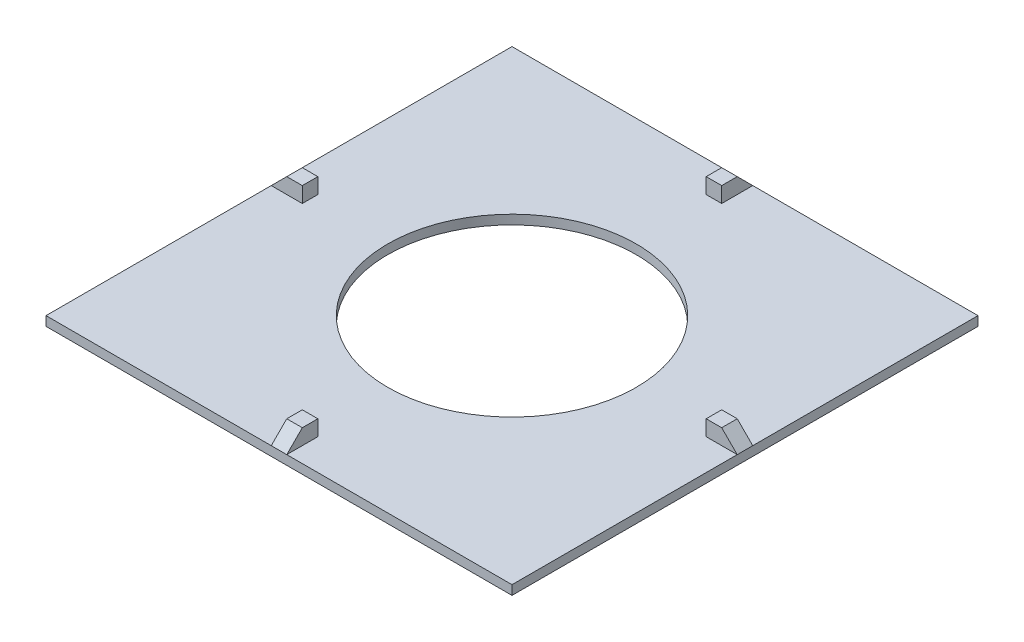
from build123d import *

# Parameters (mm, degrees)
CROQUIS1_W              = 150
CROQUIS1_H              = 150
CROQUIS1_R              = 40
SALIENTE_EXTRUIR1_DEPTH = 1.5
CROQUIS2_W              = 10
CROQUIS2_H              = 5
CROQUIS2_W_2            = 5
CROQUIS2_H_2            = 10
SALIENTE_EXTRUIR2_DEPTH = 5
CHAFL_N1_SIZE           = 5


with BuildPart() as part:
    # Croquis1 → Saliente-Extruir1 (new, symmetric)
    with BuildSketch(Plane(origin=(0, 0, 0), x_dir=(1, 0, 0), z_dir=(0, 1, 0))):
        Rectangle(CROQUIS1_W, CROQUIS1_H)
        with Locations(Location((0, 0, 0), (0, 0, 270))):
            Circle(CROQUIS1_R, mode=Mode.SUBTRACT)
    extrude(amount=SALIENTE_EXTRUIR1_DEPTH, both=True)

    # Croquis2 → Saliente-Extruir2 (add)
    with BuildSketch(Plane(origin=(0, 1.5, 0), x_dir=(1, 0, 0), z_dir=(0, 1, 0))):
        with Locations((70, 0)):
            Rectangle(CROQUIS2_W, CROQUIS2_H)
        with Locations((-70, 0)):
            Rectangle(CROQUIS2_W, CROQUIS2_H)
        with Locations((0, 70)):
            Rectangle(CROQUIS2_W_2, CROQUIS2_H_2)
        with Locations((0, -70)):
            Rectangle(CROQUIS2_W_2, CROQUIS2_H_2)
    extrude(amount=SALIENTE_EXTRUIR2_DEPTH)

    # Chafl_n1
    chafl_n1_edges = [part.edges().sort_by_distance(p)[0] for p in [
        (-75, 6.5, 0),
        (0, 6.5, -75),
        (75, 6.5, 0),
        (0, 6.5, 75),
    ]]
    chamfer(chafl_n1_edges, length=CHAFL_N1_SIZE)


solid = part.part
